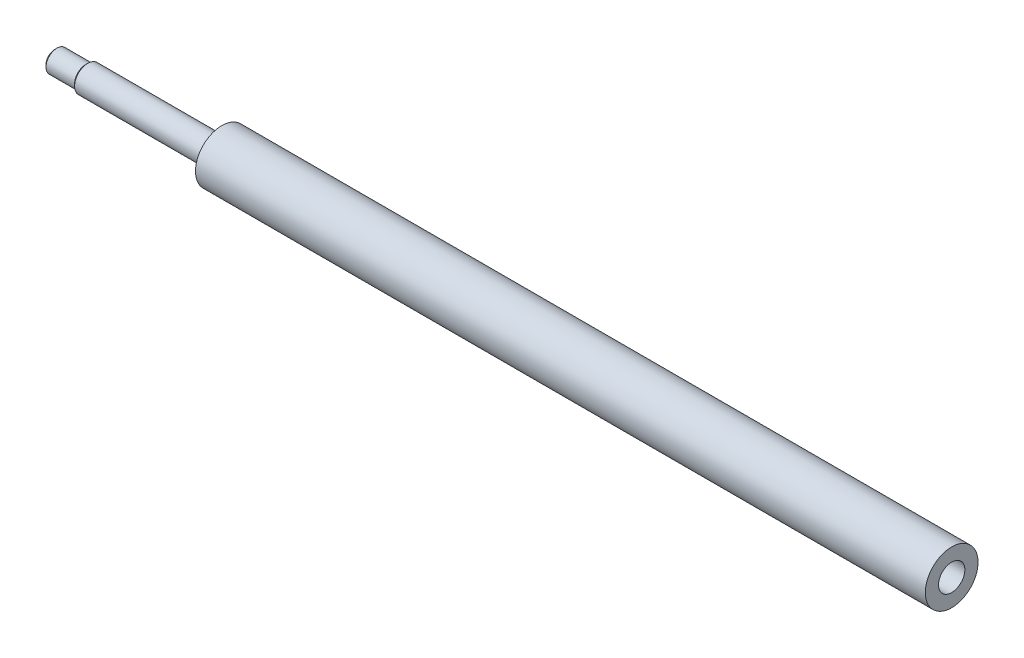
ISO-10303-21;
HEADER;
FILE_DESCRIPTION(('STEP AP214'),'2;1');
FILE_NAME('part.step','',(''),(''),'','','');
FILE_SCHEMA(('AUTOMOTIVE_DESIGN { 1 0 10303 214 1 1 1 1 }'));
ENDSEC;
DATA;
#1=APPLICATION_CONTEXT('core data for automotive mechanical design processes');
#2=APPLICATION_PROTOCOL_DEFINITION('international standard','automotive_design',2000,#1);
#3=PRODUCT_CONTEXT('',#1,'mechanical');
#4=PRODUCT('Part','Part','',(#3));
#5=PRODUCT_RELATED_PRODUCT_CATEGORY('part','',(#4));
#6=PRODUCT_DEFINITION_FORMATION('','',#4);
#7=PRODUCT_DEFINITION_CONTEXT('part definition',#1,'design');
#8=PRODUCT_DEFINITION('design','',#6,#7);
#9=PRODUCT_DEFINITION_SHAPE('','',#8);
#10=(LENGTH_UNIT() NAMED_UNIT(*) SI_UNIT(.MILLI.,.METRE.));
#11=(NAMED_UNIT(*) PLANE_ANGLE_UNIT() SI_UNIT($,.RADIAN.));
#12=(NAMED_UNIT(*) SI_UNIT($,.STERADIAN.) SOLID_ANGLE_UNIT());
#13=UNCERTAINTY_MEASURE_WITH_UNIT(LENGTH_MEASURE(1.E-05),#10,'distance_accuracy_value','');
#14=(GEOMETRIC_REPRESENTATION_CONTEXT(3) GLOBAL_UNCERTAINTY_ASSIGNED_CONTEXT((#13)) GLOBAL_UNIT_ASSIGNED_CONTEXT((#10,
#11,#12)) REPRESENTATION_CONTEXT('',''));
#15=CARTESIAN_POINT('',(0.,0.,0.));
#16=DIRECTION('',(0.,0.,1.));
#17=DIRECTION('',(1.,0.,0.));
#18=AXIS2_PLACEMENT_3D('',#15,#16,#17);
#19=CARTESIAN_POINT('',(-38.,-2.7936044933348,0.44246348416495));
#20=DIRECTION('',(-1.,0.,0.));
#21=DIRECTION('',(0.,0.809016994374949,0.587785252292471));
#22=AXIS2_PLACEMENT_3D('',#19,#20,#21);
#23=PLANE('',#22);
#24=CARTESIAN_POINT('',(-38.,0.,0.));
#25=DIRECTION('',(1.,0.,0.));
#26=DIRECTION('',(0.,0.,-1.));
#27=AXIS2_PLACEMENT_3D('',#24,#25,#26);
#28=CIRCLE('',#27,1.99999999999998);
#29=CARTESIAN_POINT('',(-38.,0.,-1.99999999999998));
#30=VERTEX_POINT('',#29);
#31=EDGE_CURVE('E51',#30,#30,#28,.F.);
#32=ORIENTED_EDGE('',*,*,#31,.T.);
#33=EDGE_LOOP('',(#32));
#34=FACE_BOUND('',#33,.T.);
#35=ADVANCED_FACE('F13',(#34),#23,.T.);
#36=CARTESIAN_POINT('',(148.,-0.66369522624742,-4.1904067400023));
#37=DIRECTION('',(1.,0.,0.));
#38=DIRECTION('',(0.,0.809016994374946,0.587785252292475));
#39=AXIS2_PLACEMENT_3D('',#36,#37,#38);
#40=PLANE('',#39);
#41=CARTESIAN_POINT('',(148.,0.,0.));
#42=DIRECTION('',(-1.,0.,0.));
#43=DIRECTION('',(0.,0.,1.));
#44=AXIS2_PLACEMENT_3D('',#41,#42,#43);
#45=CIRCLE('',#44,2.99999999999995);
#46=CARTESIAN_POINT('',(148.,0.,3.00000000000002));
#47=VERTEX_POINT('',#46);
#48=EDGE_CURVE('E48',#47,#47,#45,.T.);
#49=ORIENTED_EDGE('',*,*,#48,.F.);
#50=EDGE_LOOP('',(#49));
#51=FACE_BOUND('',#50,.T.);
#52=ADVANCED_FACE('F60',(#51),#40,.T.);
#53=CARTESIAN_POINT('',(-37.5,0.,0.));
#54=DIRECTION('',(1.,0.,0.));
#55=DIRECTION('',(0.,0.,-1.));
#56=AXIS2_PLACEMENT_3D('',#53,#54,#55);
#57=CONICAL_SURFACE('',#56,2.50000000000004,0.785398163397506);
#58=CARTESIAN_POINT('',(-37.5,0.,0.));
#59=DIRECTION('',(-1.,0.,0.));
#60=DIRECTION('',(0.,0.809016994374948,0.587785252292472));
#61=AXIS2_PLACEMENT_3D('',#58,#59,#60);
#62=CIRCLE('',#61,2.50000000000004);
#63=CARTESIAN_POINT('',(-37.5,2.0225424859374,1.4694631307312));
#64=VERTEX_POINT('',#63);
#65=EDGE_CURVE('E45',#64,#64,#62,.T.);
#66=ORIENTED_EDGE('',*,*,#65,.T.);
#67=EDGE_LOOP('',(#66));
#68=FACE_BOUND('',#67,.T.);
#69=ORIENTED_EDGE('',*,*,#31,.F.);
#70=EDGE_LOOP('',(#69));
#71=FACE_BOUND('',#70,.T.);
#72=ADVANCED_FACE('F57',(#68,#71),#57,.T.);
#73=CARTESIAN_POINT('',(166.,0.,0.));
#74=DIRECTION('',(-1.,0.,0.));
#75=DIRECTION('',(0.,0.,1.));
#76=AXIS2_PLACEMENT_3D('',#73,#74,#75);
#77=CYLINDRICAL_SURFACE('',#76,2.99999999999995);
#78=ORIENTED_EDGE('',*,*,#48,.T.);
#79=EDGE_LOOP('',(#78));
#80=FACE_BOUND('',#79,.T.);
#81=CARTESIAN_POINT('',(166.,0.,0.));
#82=DIRECTION('',(-1.,0.,0.));
#83=DIRECTION('',(0.,0.,1.));
#84=AXIS2_PLACEMENT_3D('',#81,#82,#83);
#85=CIRCLE('',#84,2.99999999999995);
#86=CARTESIAN_POINT('',(166.,0.,2.99999999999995));
#87=VERTEX_POINT('',#86);
#88=EDGE_CURVE('E42',#87,#87,#85,.T.);
#89=ORIENTED_EDGE('',*,*,#88,.F.);
#90=EDGE_LOOP('',(#89));
#91=FACE_BOUND('',#90,.T.);
#92=ADVANCED_FACE('F59',(#80,#91),#77,.F.);
#93=CARTESIAN_POINT('',(-31.,0.,0.));
#94=DIRECTION('',(-1.,0.,0.));
#95=DIRECTION('',(0.,0.,1.));
#96=AXIS2_PLACEMENT_3D('',#93,#94,#95);
#97=CYLINDRICAL_SURFACE('',#96,2.50000000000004);
#98=CARTESIAN_POINT('',(-31.,0.,0.));
#99=DIRECTION('',(-1.,0.,0.));
#100=DIRECTION('',(0.,0.809016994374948,0.587785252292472));
#101=AXIS2_PLACEMENT_3D('',#98,#99,#100);
#102=CIRCLE('',#101,2.50000000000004);
#103=CARTESIAN_POINT('',(-31.,2.0225424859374,1.4694631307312));
#104=VERTEX_POINT('',#103);
#105=EDGE_CURVE('E39',#104,#104,#102,.T.);
#106=ORIENTED_EDGE('',*,*,#105,.T.);
#107=EDGE_LOOP('',(#106));
#108=FACE_BOUND('',#107,.T.);
#109=ORIENTED_EDGE('',*,*,#65,.F.);
#110=EDGE_LOOP('',(#109));
#111=FACE_BOUND('',#110,.T.);
#112=ADVANCED_FACE('F68',(#108,#111),#97,.T.);
#113=CARTESIAN_POINT('',(166.,-1.3273904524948,-8.3808134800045));
#114=DIRECTION('',(1.,0.,0.));
#115=DIRECTION('',(0.,0.809016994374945,0.587785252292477));
#116=AXIS2_PLACEMENT_3D('',#113,#114,#115);
#117=PLANE('',#116);
#118=ORIENTED_EDGE('',*,*,#88,.T.);
#119=EDGE_LOOP('',(#118));
#120=FACE_BOUND('',#119,.T.);
#121=CARTESIAN_POINT('',(166.,0.,0.));
#122=DIRECTION('',(-1.,0.,0.));
#123=DIRECTION('',(0.,0.,1.));
#124=AXIS2_PLACEMENT_3D('',#121,#122,#123);
#125=CIRCLE('',#124,5.99999999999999);
#126=CARTESIAN_POINT('',(166.,0.,5.99999999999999));
#127=VERTEX_POINT('',#126);
#128=EDGE_CURVE('E36',#127,#127,#125,.F.);
#129=ORIENTED_EDGE('',*,*,#128,.T.);
#130=EDGE_LOOP('',(#129));
#131=FACE_BOUND('',#130,.T.);
#132=ADVANCED_FACE('F92',(#120,#131),#117,.T.);
#133=CARTESIAN_POINT('',(-30.5,0.,0.));
#134=DIRECTION('',(1.,0.,0.));
#135=DIRECTION('',(0.,0.,-1.));
#136=AXIS2_PLACEMENT_3D('',#133,#134,#135);
#137=CONICAL_SURFACE('',#136,2.99999999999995,0.785398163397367);
#138=CARTESIAN_POINT('',(-30.5,0.,0.));
#139=DIRECTION('',(-1.,0.,0.));
#140=DIRECTION('',(0.,0.809016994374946,0.587785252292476));
#141=AXIS2_PLACEMENT_3D('',#138,#139,#140);
#142=CIRCLE('',#141,2.99999999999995);
#143=CARTESIAN_POINT('',(-30.5,2.4270509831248,1.7633557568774));
#144=VERTEX_POINT('',#143);
#145=EDGE_CURVE('E26',#144,#144,#142,.T.);
#146=ORIENTED_EDGE('',*,*,#145,.T.);
#147=EDGE_LOOP('',(#146));
#148=FACE_BOUND('',#147,.T.);
#149=ORIENTED_EDGE('',*,*,#105,.F.);
#150=EDGE_LOOP('',(#149));
#151=FACE_BOUND('',#150,.T.);
#152=ADVANCED_FACE('F86',(#148,#151),#137,.T.);
#153=CARTESIAN_POINT('',(166.,0.,0.));
#154=DIRECTION('',(-1.,0.,0.));
#155=DIRECTION('',(0.,0.,1.));
#156=AXIS2_PLACEMENT_3D('',#153,#154,#155);
#157=CYLINDRICAL_SURFACE('',#156,5.99999999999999);
#158=ORIENTED_EDGE('',*,*,#128,.F.);
#159=EDGE_LOOP('',(#158));
#160=FACE_BOUND('',#159,.T.);
#161=CARTESIAN_POINT('',(0.,-2.25681399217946E-13,3.10623797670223E-13));
#162=DIRECTION('',(-1.,0.,0.));
#163=DIRECTION('',(0.,0.,1.));
#164=AXIS2_PLACEMENT_3D('',#161,#162,#163);
#165=CIRCLE('',#164,5.99999999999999);
#166=CARTESIAN_POINT('',(0.,-2.25681399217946E-13,6.0000000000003));
#167=VERTEX_POINT('',#166);
#168=EDGE_CURVE('E21',#167,#167,#165,.T.);
#169=ORIENTED_EDGE('',*,*,#168,.F.);
#170=EDGE_LOOP('',(#169));
#171=FACE_BOUND('',#170,.T.);
#172=ADVANCED_FACE('F79',(#160,#171),#157,.T.);
#173=CARTESIAN_POINT('',(0.,0.,0.));
#174=DIRECTION('',(-1.,0.,0.));
#175=DIRECTION('',(0.,0.,1.));
#176=AXIS2_PLACEMENT_3D('',#173,#174,#175);
#177=CYLINDRICAL_SURFACE('',#176,2.99999999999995);
#178=CARTESIAN_POINT('',(0.,0.,0.));
#179=DIRECTION('',(-1.,0.,0.));
#180=DIRECTION('',(0.,0.,1.));
#181=AXIS2_PLACEMENT_3D('',#178,#179,#180);
#182=CIRCLE('',#181,2.99999999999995);
#183=CARTESIAN_POINT('',(0.,0.,2.99999999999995));
#184=VERTEX_POINT('',#183);
#185=EDGE_CURVE('E9',#184,#184,#182,.F.);
#186=ORIENTED_EDGE('',*,*,#185,.F.);
#187=EDGE_LOOP('',(#186));
#188=FACE_BOUND('',#187,.T.);
#189=ORIENTED_EDGE('',*,*,#145,.F.);
#190=EDGE_LOOP('',(#189));
#191=FACE_BOUND('',#190,.T.);
#192=ADVANCED_FACE('F75',(#188,#191),#177,.T.);
#193=CARTESIAN_POINT('',(0.,-8.3808134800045,1.3273904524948));
#194=DIRECTION('',(-1.,0.,0.));
#195=DIRECTION('',(0.,0.809016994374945,0.587785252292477));
#196=AXIS2_PLACEMENT_3D('',#193,#194,#195);
#197=PLANE('',#196);
#198=ORIENTED_EDGE('',*,*,#185,.T.);
#199=EDGE_LOOP('',(#198));
#200=FACE_BOUND('',#199,.T.);
#201=ORIENTED_EDGE('',*,*,#168,.T.);
#202=EDGE_LOOP('',(#201));
#203=FACE_BOUND('',#202,.T.);
#204=ADVANCED_FACE('F15',(#200,#203),#197,.T.);
#205=CLOSED_SHELL('',(#35,#52,#72,#92,#112,#132,#152,#172,#192,#204));
#206=MANIFOLD_SOLID_BREP('B1',#205);
#207=ADVANCED_BREP_SHAPE_REPRESENTATION('',(#18,#206),#14);
#208=SHAPE_DEFINITION_REPRESENTATION(#9,#207);
ENDSEC;
END-ISO-10303-21;
